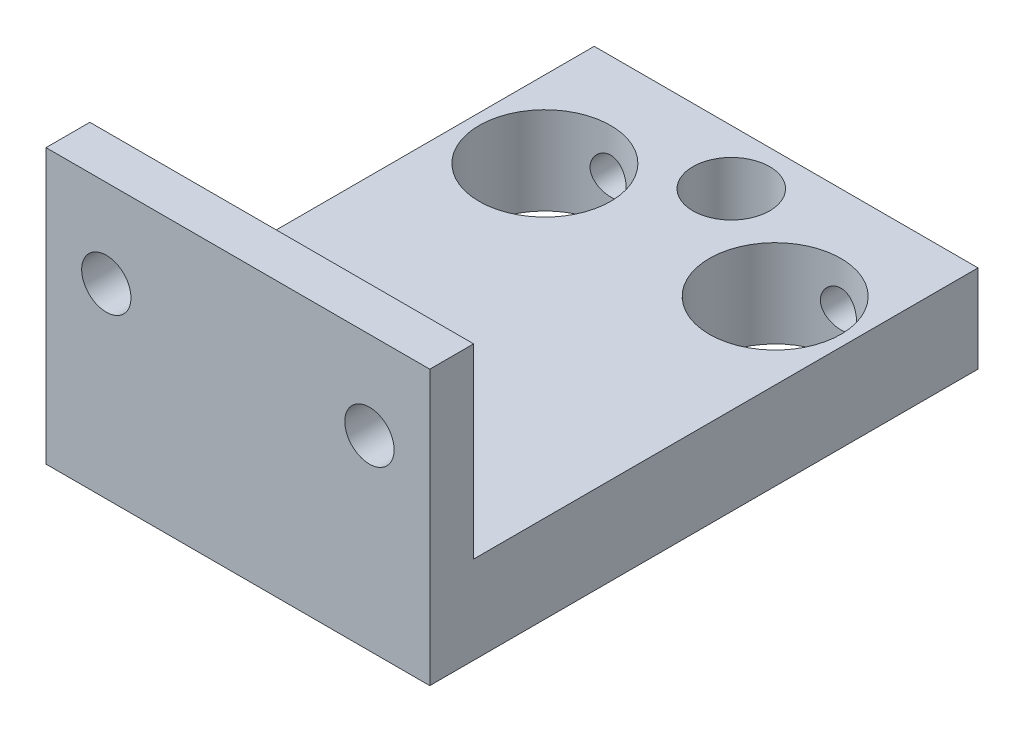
ISO-10303-21;
HEADER;
FILE_DESCRIPTION(('STEP AP214'),'2;1');
FILE_NAME('part.step','',(''),(''),'','','');
FILE_SCHEMA(('AUTOMOTIVE_DESIGN { 1 0 10303 214 1 1 1 1 }'));
ENDSEC;
DATA;
#1=APPLICATION_CONTEXT('core data for automotive mechanical design processes');
#2=APPLICATION_PROTOCOL_DEFINITION('international standard','automotive_design',2000,#1);
#3=PRODUCT_CONTEXT('',#1,'mechanical');
#4=PRODUCT('Part','Part','',(#3));
#5=PRODUCT_RELATED_PRODUCT_CATEGORY('part','',(#4));
#6=PRODUCT_DEFINITION_FORMATION('','',#4);
#7=PRODUCT_DEFINITION_CONTEXT('part definition',#1,'design');
#8=PRODUCT_DEFINITION('design','',#6,#7);
#9=PRODUCT_DEFINITION_SHAPE('','',#8);
#10=(LENGTH_UNIT() NAMED_UNIT(*) SI_UNIT(.MILLI.,.METRE.));
#11=(NAMED_UNIT(*) PLANE_ANGLE_UNIT() SI_UNIT($,.RADIAN.));
#12=(NAMED_UNIT(*) SI_UNIT($,.STERADIAN.) SOLID_ANGLE_UNIT());
#13=UNCERTAINTY_MEASURE_WITH_UNIT(LENGTH_MEASURE(1.E-05),#10,'distance_accuracy_value','');
#14=(GEOMETRIC_REPRESENTATION_CONTEXT(3) GLOBAL_UNCERTAINTY_ASSIGNED_CONTEXT((#13)) GLOBAL_UNIT_ASSIGNED_CONTEXT((#10,
#11,#12)) REPRESENTATION_CONTEXT('',''));
#15=CARTESIAN_POINT('',(0.,0.,0.));
#16=DIRECTION('',(0.,0.,1.));
#17=DIRECTION('',(1.,0.,0.));
#18=AXIS2_PLACEMENT_3D('',#15,#16,#17);
#19=CARTESIAN_POINT('',(-12.,9.,2.));
#20=DIRECTION('',(0.,0.,-1.));
#21=DIRECTION('',(-1.,0.,0.));
#22=AXIS2_PLACEMENT_3D('',#19,#20,#21);
#23=CYLINDRICAL_SURFACE('',#22,2.25);
#24=CARTESIAN_POINT('',(-12.,9.,2.));
#25=DIRECTION('',(0.,0.,-1.));
#26=DIRECTION('',(-1.,0.,0.));
#27=AXIS2_PLACEMENT_3D('',#24,#25,#26);
#28=CIRCLE('',#27,2.25);
#29=CARTESIAN_POINT('',(-14.25,9.,2.));
#30=VERTEX_POINT('',#29);
#31=EDGE_CURVE('E130',#30,#30,#28,.F.);
#32=ORIENTED_EDGE('',*,*,#31,.T.);
#33=EDGE_LOOP('',(#32));
#34=FACE_BOUND('',#33,.T.);
#35=CARTESIAN_POINT('',(-12.,9.,-2.));
#36=DIRECTION('',(0.,0.,-1.));
#37=DIRECTION('',(-1.,0.,0.));
#38=AXIS2_PLACEMENT_3D('',#35,#36,#37);
#39=CIRCLE('',#38,2.25);
#40=CARTESIAN_POINT('',(-14.25,9.,-2.));
#41=VERTEX_POINT('',#40);
#42=EDGE_CURVE('E20',#41,#41,#39,.T.);
#43=ORIENTED_EDGE('',*,*,#42,.T.);
#44=EDGE_LOOP('',(#43));
#45=FACE_BOUND('',#44,.T.);
#46=ADVANCED_FACE('F17',(#34,#45),#23,.F.);
#47=CARTESIAN_POINT('',(12.,9.,2.));
#48=DIRECTION('',(0.,0.,-1.));
#49=DIRECTION('',(-1.,0.,0.));
#50=AXIS2_PLACEMENT_3D('',#47,#48,#49);
#51=CYLINDRICAL_SURFACE('',#50,2.25);
#52=CARTESIAN_POINT('',(12.,9.,2.));
#53=DIRECTION('',(0.,0.,-1.));
#54=DIRECTION('',(-1.,0.,0.));
#55=AXIS2_PLACEMENT_3D('',#52,#53,#54);
#56=CIRCLE('',#55,2.25);
#57=CARTESIAN_POINT('',(9.75,9.,2.));
#58=VERTEX_POINT('',#57);
#59=EDGE_CURVE('E88',#58,#58,#56,.F.);
#60=ORIENTED_EDGE('',*,*,#59,.T.);
#61=EDGE_LOOP('',(#60));
#62=FACE_BOUND('',#61,.T.);
#63=CARTESIAN_POINT('',(12.,9.,-2.));
#64=DIRECTION('',(0.,0.,-1.));
#65=DIRECTION('',(-1.,0.,0.));
#66=AXIS2_PLACEMENT_3D('',#63,#64,#65);
#67=CIRCLE('',#66,2.25);
#68=CARTESIAN_POINT('',(9.75,9.,-2.));
#69=VERTEX_POINT('',#68);
#70=EDGE_CURVE('E107',#69,#69,#67,.T.);
#71=ORIENTED_EDGE('',*,*,#70,.T.);
#72=EDGE_LOOP('',(#71));
#73=FACE_BOUND('',#72,.T.);
#74=ADVANCED_FACE('F174',(#62,#73),#51,.F.);
#75=CARTESIAN_POINT('',(10.5,-4.,-48.));
#76=DIRECTION('',(0.,0.,-1.));
#77=DIRECTION('',(-1.,0.,0.));
#78=AXIS2_PLACEMENT_3D('',#75,#76,#77);
#79=CYLINDRICAL_SURFACE('',#78,1.65);
#80=CARTESIAN_POINT('',(10.5000000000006,-2.35,-42.5));
#81=CARTESIAN_POINT('',(10.4091866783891,-2.3500039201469,-42.4999975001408));
#82=CARTESIAN_POINT('',(10.3183231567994,-2.35752577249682,-42.4979169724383));
#83=CARTESIAN_POINT('',(10.1391892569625,-2.38736942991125,-42.4898145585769));
#84=CARTESIAN_POINT('',(10.05092140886,-2.40970520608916,-42.4837889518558));
#85=CARTESIAN_POINT('',(9.87963603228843,-2.46838950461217,-42.4684615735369));
#86=CARTESIAN_POINT('',(9.79661072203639,-2.50471666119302,-42.4591647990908));
#87=CARTESIAN_POINT('',(9.63784239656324,-2.59027680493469,-42.4382745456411));
#88=CARTESIAN_POINT('',(9.562099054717,-2.63950921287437,-42.4266811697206));
#89=CARTESIAN_POINT('',(9.4181761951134,-2.7507559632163,-42.4021275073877));
#90=CARTESIAN_POINT('',(9.35019997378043,-2.8130279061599,-42.3891427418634));
#91=CARTESIAN_POINT('',(9.22549792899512,-2.94805285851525,-42.3634212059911));
#92=CARTESIAN_POINT('',(9.16877596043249,-3.020809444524,-42.3506845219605));
#93=CARTESIAN_POINT('',(9.06717908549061,-3.17639868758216,-42.3266463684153));
#94=CARTESIAN_POINT('',(9.02254721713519,-3.25939519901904,-42.3153764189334));
#95=CARTESIAN_POINT('',(8.94799532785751,-3.43202252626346,-42.2959278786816));
#96=CARTESIAN_POINT('',(8.91805785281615,-3.52164532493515,-42.2877456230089));
#97=CARTESIAN_POINT('',(8.8807309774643,-3.67642396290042,-42.277387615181));
#98=CARTESIAN_POINT('',(8.86922786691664,-3.7405455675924,-42.2741359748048));
#99=CARTESIAN_POINT('',(8.85386114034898,-3.86976950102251,-42.2697738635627));
#100=CARTESIAN_POINT('',(8.84999714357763,-3.9348717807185,-42.2686632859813));
#101=CARTESIAN_POINT('',(8.85000397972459,-4.09074021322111,-42.2686682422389));
#102=CARTESIAN_POINT('',(8.85751413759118,-4.18153077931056,-42.2708309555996));
#103=CARTESIAN_POINT('',(8.88730711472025,-4.36051289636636,-42.2792258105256));
#104=CARTESIAN_POINT('',(8.90960416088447,-4.44870185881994,-42.2854618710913));
#105=CARTESIAN_POINT('',(8.96817531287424,-4.61982002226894,-42.3012433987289));
#106=CARTESIAN_POINT('',(9.00442628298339,-4.70275766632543,-42.3107833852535));
#107=CARTESIAN_POINT('',(9.08980667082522,-4.86137719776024,-42.3320907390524));
#108=CARTESIAN_POINT('',(9.13893568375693,-4.93705931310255,-42.3438580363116));
#109=CARTESIAN_POINT('',(9.25007444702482,-5.08104289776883,-42.3686452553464));
#110=CARTESIAN_POINT('',(9.31236509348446,-5.14912357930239,-42.3816884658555));
#111=CARTESIAN_POINT('',(9.44747231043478,-5.27402964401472,-42.4073603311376));
#112=CARTESIAN_POINT('',(9.5202921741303,-5.33085149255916,-42.4199888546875));
#113=CARTESIAN_POINT('',(9.67594504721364,-5.43255988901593,-42.4436716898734));
#114=CARTESIAN_POINT('',(9.75893111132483,-5.47721993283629,-42.4546945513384));
#115=CARTESIAN_POINT('',(9.93153642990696,-5.55182691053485,-42.4736383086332));
#116=CARTESIAN_POINT('',(10.0211478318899,-5.58179095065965,-42.4815628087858));
#117=CARTESIAN_POINT('',(10.1759954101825,-5.61918713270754,-42.4915824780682));
#118=CARTESIAN_POINT('',(10.2402033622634,-5.63072114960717,-42.4947223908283));
#119=CARTESIAN_POINT('',(10.3695989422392,-5.64612882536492,-42.4989320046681));
#120=CARTESIAN_POINT('',(10.4347865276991,-5.6500028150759,-42.5000017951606));
#121=CARTESIAN_POINT('',(10.5908133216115,-5.64999607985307,-42.4999975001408));
#122=CARTESIAN_POINT('',(10.6816768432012,-5.64247422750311,-42.4979169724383));
#123=CARTESIAN_POINT('',(10.8608107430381,-5.61263057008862,-42.4898145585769));
#124=CARTESIAN_POINT('',(10.9490785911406,-5.59029479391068,-42.4837889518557));
#125=CARTESIAN_POINT('',(11.1203639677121,-5.5316104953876,-42.4684615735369));
#126=CARTESIAN_POINT('',(11.2033892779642,-5.49528333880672,-42.4591647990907));
#127=CARTESIAN_POINT('',(11.3621576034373,-5.40972319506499,-42.438274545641));
#128=CARTESIAN_POINT('',(11.4379009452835,-5.36049078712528,-42.4266811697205));
#129=CARTESIAN_POINT('',(11.5818238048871,-5.24924403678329,-42.4021275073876));
#130=CARTESIAN_POINT('',(11.64980002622,-5.18697209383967,-42.3891427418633));
#131=CARTESIAN_POINT('',(11.7745020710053,-5.05194714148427,-42.3634212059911));
#132=CARTESIAN_POINT('',(11.8312240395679,-4.9791905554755,-42.3506845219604));
#133=CARTESIAN_POINT('',(11.9328209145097,-4.82360131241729,-42.3266463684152));
#134=CARTESIAN_POINT('',(11.9774527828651,-4.7406048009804,-42.3153764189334));
#135=CARTESIAN_POINT('',(12.0520046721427,-4.56797747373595,-42.2959278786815));
#136=CARTESIAN_POINT('',(12.081942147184,-4.47835467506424,-42.2877456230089));
#137=CARTESIAN_POINT('',(12.1192690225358,-4.32357603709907,-42.277387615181));
#138=CARTESIAN_POINT('',(12.1307721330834,-4.25945443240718,-42.2741359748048));
#139=CARTESIAN_POINT('',(12.146138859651,-4.13023049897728,-42.2697738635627));
#140=CARTESIAN_POINT('',(12.1500028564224,-4.06512821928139,-42.2686632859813));
#141=CARTESIAN_POINT('',(12.1499960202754,-3.90925978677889,-42.2686682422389));
#142=CARTESIAN_POINT('',(12.1424858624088,-3.81846922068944,-42.2708309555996));
#143=CARTESIAN_POINT('',(12.1126928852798,-3.63948710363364,-42.2792258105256));
#144=CARTESIAN_POINT('',(12.0903958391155,-3.55129814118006,-42.2854618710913));
#145=CARTESIAN_POINT('',(12.0318246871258,-3.38017997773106,-42.3012433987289));
#146=CARTESIAN_POINT('',(11.9955737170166,-3.29724233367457,-42.3107833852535));
#147=CARTESIAN_POINT('',(11.9101933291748,-3.13862280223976,-42.3320907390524));
#148=CARTESIAN_POINT('',(11.8610643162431,-3.06294068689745,-42.3438580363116));
#149=CARTESIAN_POINT('',(11.7499255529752,-2.91895710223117,-42.3686452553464));
#150=CARTESIAN_POINT('',(11.6876349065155,-2.85087642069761,-42.3816884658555));
#151=CARTESIAN_POINT('',(11.5525276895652,-2.72597035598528,-42.4073603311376));
#152=CARTESIAN_POINT('',(11.4797078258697,-2.66914850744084,-42.4199888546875));
#153=CARTESIAN_POINT('',(11.3240549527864,-2.56744011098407,-42.4436716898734));
#154=CARTESIAN_POINT('',(11.2410688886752,-2.52278006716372,-42.4546945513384));
#155=CARTESIAN_POINT('',(11.068463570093,-2.44817308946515,-42.4736383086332));
#156=CARTESIAN_POINT('',(10.9788521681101,-2.41820904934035,-42.4815628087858));
#157=CARTESIAN_POINT('',(10.8240045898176,-2.38081286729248,-42.4915824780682));
#158=CARTESIAN_POINT('',(10.7597966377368,-2.36927885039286,-42.4947223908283));
#159=CARTESIAN_POINT('',(10.6304010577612,-2.35387117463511,-42.4989320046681));
#160=CARTESIAN_POINT('',(10.5652134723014,-2.34999718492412,-42.5000017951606));
#161=CARTESIAN_POINT('',(10.5000000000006,-2.35,-42.5));
#162=B_SPLINE_CURVE_WITH_KNOTS('',3,(#80,#81,#82,#83,#84,#85,#86,#87,#88,#89,#90,#91,#92,#93,
#94,#95,#96,#97,#98,#99,#100,#101,#102,#103,#104,#105,#106,#107,#108,#109,#110,#111,#112,#113,
#114,#115,#116,#117,#118,#119,#120,#121,#122,#123,#124,#125,#126,#127,#128,#129,#130,#131,#132,
#133,#134,#135,#136,#137,#138,#139,#140,#141,#142,#143,#144,#145,#146,#147,#148,#149,#150,#151,
#152,#153,#154,#155,#156,#157,#158,#159,#160,#161),.UNSPECIFIED.,.T.,.F.,(4,2,2,2,2,2,2,2,2,2,2,
2,2,2,2,2,2,2,2,2,2,2,2,2,2,2,2,2,2,2,2,2,2,2,2,2,2,2,2,2,4),(0.,0.272197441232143,
0.544651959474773,0.816692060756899,1.08871995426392,1.36673826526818,1.64485164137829,
1.92819882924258,2.21120863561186,2.40642863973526,2.60163891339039,2.8736165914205,
3.14585632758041,3.41764661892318,3.689428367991,3.96773434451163,4.24612755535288,
4.52939733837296,4.81233660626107,5.00781130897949,5.20327756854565,5.4754750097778,
5.74792952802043,6.01996962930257,6.2919975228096,6.57001583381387,6.84812920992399,
7.13147639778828,7.41448620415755,7.60970620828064,7.80491648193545,8.07689415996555,
8.34913389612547,8.62092418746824,8.89270593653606,9.17101191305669,9.44940512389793,
9.73267490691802,10.0156141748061,10.2110888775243,10.4065551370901),.UNSPECIFIED.);
#163=CARTESIAN_POINT('',(10.5000000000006,-2.35,-42.5));
#164=VERTEX_POINT('',#163);
#165=EDGE_CURVE('E164',#164,#164,#162,.T.);
#166=ORIENTED_EDGE('',*,*,#165,.T.);
#167=EDGE_LOOP('',(#166));
#168=FACE_BOUND('',#167,.T.);
#169=CARTESIAN_POINT('',(10.5,-4.,-48.));
#170=DIRECTION('',(0.,0.,-1.));
#171=DIRECTION('',(-1.,0.,0.));
#172=AXIS2_PLACEMENT_3D('',#169,#170,#171);
#173=CIRCLE('',#172,1.65);
#174=CARTESIAN_POINT('',(8.85,-4.,-48.));
#175=VERTEX_POINT('',#174);
#176=EDGE_CURVE('E125',#175,#175,#173,.T.);
#177=ORIENTED_EDGE('',*,*,#176,.T.);
#178=EDGE_LOOP('',(#177));
#179=FACE_BOUND('',#178,.T.);
#180=ADVANCED_FACE('F171',(#168,#179),#79,.F.);
#181=CARTESIAN_POINT('',(-10.5,-4.,-48.));
#182=DIRECTION('',(0.,0.,-1.));
#183=DIRECTION('',(-1.,0.,0.));
#184=AXIS2_PLACEMENT_3D('',#181,#182,#183);
#185=CYLINDRICAL_SURFACE('',#184,1.65);
#186=CARTESIAN_POINT('',(-10.4999999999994,-2.35,-42.5));
#187=CARTESIAN_POINT('',(-10.5908133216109,-2.3500039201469,-42.4999975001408));
#188=CARTESIAN_POINT('',(-10.6816768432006,-2.35752577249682,-42.4979169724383));
#189=CARTESIAN_POINT('',(-10.8608107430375,-2.38736942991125,-42.4898145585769));
#190=CARTESIAN_POINT('',(-10.94907859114,-2.40970520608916,-42.4837889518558));
#191=CARTESIAN_POINT('',(-11.1203639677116,-2.46838950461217,-42.4684615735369));
#192=CARTESIAN_POINT('',(-11.2033892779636,-2.50471666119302,-42.4591647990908));
#193=CARTESIAN_POINT('',(-11.3621576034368,-2.59027680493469,-42.4382745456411));
#194=CARTESIAN_POINT('',(-11.437900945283,-2.63950921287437,-42.4266811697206));
#195=CARTESIAN_POINT('',(-11.5818238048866,-2.7507559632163,-42.4021275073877));
#196=CARTESIAN_POINT('',(-11.6498000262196,-2.8130279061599,-42.3891427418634));
#197=CARTESIAN_POINT('',(-11.7745020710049,-2.94805285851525,-42.3634212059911));
#198=CARTESIAN_POINT('',(-11.8312240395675,-3.02080944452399,-42.3506845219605));
#199=CARTESIAN_POINT('',(-11.9328209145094,-3.17639868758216,-42.3266463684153));
#200=CARTESIAN_POINT('',(-11.9774527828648,-3.25939519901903,-42.3153764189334));
#201=CARTESIAN_POINT('',(-12.0520046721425,-3.43202252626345,-42.2959278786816));
#202=CARTESIAN_POINT('',(-12.0819421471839,-3.52164532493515,-42.2877456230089));
#203=CARTESIAN_POINT('',(-12.1192690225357,-3.67642396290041,-42.277387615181));
#204=CARTESIAN_POINT('',(-12.1307721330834,-3.7405455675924,-42.2741359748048));
#205=CARTESIAN_POINT('',(-12.146138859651,-3.86976950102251,-42.2697738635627));
#206=CARTESIAN_POINT('',(-12.1500028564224,-3.9348717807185,-42.2686632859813));
#207=CARTESIAN_POINT('',(-12.1499960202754,-4.09074021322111,-42.2686682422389));
#208=CARTESIAN_POINT('',(-12.1424858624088,-4.18153077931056,-42.2708309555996));
#209=CARTESIAN_POINT('',(-12.1126928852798,-4.36051289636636,-42.2792258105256));
#210=CARTESIAN_POINT('',(-12.0903958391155,-4.44870185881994,-42.2854618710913));
#211=CARTESIAN_POINT('',(-12.0318246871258,-4.61982002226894,-42.3012433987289));
#212=CARTESIAN_POINT('',(-11.9955737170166,-4.70275766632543,-42.3107833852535));
#213=CARTESIAN_POINT('',(-11.9101933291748,-4.86137719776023,-42.3320907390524));
#214=CARTESIAN_POINT('',(-11.8610643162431,-4.93705931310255,-42.3438580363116));
#215=CARTESIAN_POINT('',(-11.7499255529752,-5.08104289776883,-42.3686452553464));
#216=CARTESIAN_POINT('',(-11.6876349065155,-5.14912357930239,-42.3816884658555));
#217=CARTESIAN_POINT('',(-11.5525276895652,-5.27402964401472,-42.4073603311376));
#218=CARTESIAN_POINT('',(-11.4797078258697,-5.33085149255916,-42.4199888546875));
#219=CARTESIAN_POINT('',(-11.3240549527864,-5.43255988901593,-42.4436716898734));
#220=CARTESIAN_POINT('',(-11.2410688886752,-5.47721993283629,-42.4546945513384));
#221=CARTESIAN_POINT('',(-11.068463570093,-5.55182691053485,-42.4736383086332));
#222=CARTESIAN_POINT('',(-10.9788521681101,-5.58179095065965,-42.4815628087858));
#223=CARTESIAN_POINT('',(-10.8240045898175,-5.61918713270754,-42.4915824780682));
#224=CARTESIAN_POINT('',(-10.7597966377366,-5.63072114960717,-42.4947223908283));
#225=CARTESIAN_POINT('',(-10.6304010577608,-5.64612882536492,-42.4989320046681));
#226=CARTESIAN_POINT('',(-10.5652134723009,-5.6500028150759,-42.5000017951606));
#227=CARTESIAN_POINT('',(-10.4091866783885,-5.64999607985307,-42.4999975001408));
#228=CARTESIAN_POINT('',(-10.3183231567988,-5.64247422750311,-42.4979169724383));
#229=CARTESIAN_POINT('',(-10.139189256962,-5.61263057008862,-42.4898145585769));
#230=CARTESIAN_POINT('',(-10.0509214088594,-5.59029479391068,-42.4837889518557));
#231=CARTESIAN_POINT('',(-9.87963603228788,-5.5316104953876,-42.4684615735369));
#232=CARTESIAN_POINT('',(-9.79661072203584,-5.49528333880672,-42.4591647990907));
#233=CARTESIAN_POINT('',(-9.63784239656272,-5.40972319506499,-42.438274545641));
#234=CARTESIAN_POINT('',(-9.56209905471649,-5.36049078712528,-42.4266811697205));
#235=CARTESIAN_POINT('',(-9.41817619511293,-5.24924403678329,-42.4021275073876));
#236=CARTESIAN_POINT('',(-9.35019997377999,-5.18697209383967,-42.3891427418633));
#237=CARTESIAN_POINT('',(-9.22549792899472,-5.05194714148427,-42.3634212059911));
#238=CARTESIAN_POINT('',(-9.16877596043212,-4.9791905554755,-42.3506845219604));
#239=CARTESIAN_POINT('',(-9.06717908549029,-4.82360131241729,-42.3266463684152));
#240=CARTESIAN_POINT('',(-9.02254721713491,-4.7406048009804,-42.3153764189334));
#241=CARTESIAN_POINT('',(-8.94799532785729,-4.56797747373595,-42.2959278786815));
#242=CARTESIAN_POINT('',(-8.91805785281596,-4.47835467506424,-42.2877456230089));
#243=CARTESIAN_POINT('',(-8.8807309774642,-4.32357603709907,-42.277387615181));
#244=CARTESIAN_POINT('',(-8.86922786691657,-4.25945443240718,-42.2741359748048));
#245=CARTESIAN_POINT('',(-8.85386114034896,-4.13023049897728,-42.2697738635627));
#246=CARTESIAN_POINT('',(-8.84999714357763,-4.06512821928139,-42.2686632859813));
#247=CARTESIAN_POINT('',(-8.85000397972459,-3.90925978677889,-42.2686682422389));
#248=CARTESIAN_POINT('',(-8.85751413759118,-3.81846922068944,-42.2708309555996));
#249=CARTESIAN_POINT('',(-8.88730711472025,-3.63948710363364,-42.2792258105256));
#250=CARTESIAN_POINT('',(-8.90960416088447,-3.55129814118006,-42.2854618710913));
#251=CARTESIAN_POINT('',(-8.96817531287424,-3.38017997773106,-42.3012433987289));
#252=CARTESIAN_POINT('',(-9.00442628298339,-3.29724233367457,-42.3107833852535));
#253=CARTESIAN_POINT('',(-9.08980667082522,-3.13862280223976,-42.3320907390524));
#254=CARTESIAN_POINT('',(-9.13893568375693,-3.06294068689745,-42.3438580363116));
#255=CARTESIAN_POINT('',(-9.25007444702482,-2.91895710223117,-42.3686452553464));
#256=CARTESIAN_POINT('',(-9.31236509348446,-2.85087642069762,-42.3816884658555));
#257=CARTESIAN_POINT('',(-9.44747231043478,-2.72597035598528,-42.4073603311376));
#258=CARTESIAN_POINT('',(-9.5202921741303,-2.66914850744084,-42.4199888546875));
#259=CARTESIAN_POINT('',(-9.67594504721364,-2.56744011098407,-42.4436716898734));
#260=CARTESIAN_POINT('',(-9.75893111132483,-2.52278006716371,-42.4546945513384));
#261=CARTESIAN_POINT('',(-9.93153642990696,-2.44817308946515,-42.4736383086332));
#262=CARTESIAN_POINT('',(-10.02114783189,-2.41820904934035,-42.4815628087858));
#263=CARTESIAN_POINT('',(-10.1759954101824,-2.38081286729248,-42.4915824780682));
#264=CARTESIAN_POINT('',(-10.2402033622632,-2.36927885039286,-42.4947223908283));
#265=CARTESIAN_POINT('',(-10.3695989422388,-2.35387117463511,-42.4989320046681));
#266=CARTESIAN_POINT('',(-10.4347865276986,-2.34999718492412,-42.5000017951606));
#267=CARTESIAN_POINT('',(-10.4999999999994,-2.35,-42.5));
#268=B_SPLINE_CURVE_WITH_KNOTS('',3,(#186,#187,#188,#189,#190,#191,#192,#193,#194,#195,#196,
#197,#198,#199,#200,#201,#202,#203,#204,#205,#206,#207,#208,#209,#210,#211,#212,#213,#214,#215,
#216,#217,#218,#219,#220,#221,#222,#223,#224,#225,#226,#227,#228,#229,#230,#231,#232,#233,#234,
#235,#236,#237,#238,#239,#240,#241,#242,#243,#244,#245,#246,#247,#248,#249,#250,#251,#252,#253,
#254,#255,#256,#257,#258,#259,#260,#261,#262,#263,#264,#265,#266,#267),.UNSPECIFIED.,.T.,.F.,(4,
2,2,2,2,2,2,2,2,2,2,2,2,2,2,2,2,2,2,2,2,2,2,2,2,2,2,2,2,2,2,2,2,2,2,2,2,2,2,2,4),(0.,
0.272197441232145,0.544651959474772,0.8166920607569,1.08871995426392,1.36673826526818,
1.64485164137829,1.92819882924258,2.21120863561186,2.40642863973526,2.60163891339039,
2.8736165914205,3.14585632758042,3.41764661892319,3.689428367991,3.96773434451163,
4.24612755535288,4.52939733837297,4.81233660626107,5.00781130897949,5.20327756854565,
5.4754750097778,5.74792952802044,6.01996962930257,6.2919975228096,6.57001583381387,
6.84812920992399,7.13147639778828,7.41448620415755,7.60970620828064,7.80491648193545,
8.07689415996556,8.34913389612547,8.62092418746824,8.89270593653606,9.17101191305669,
9.44940512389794,9.73267490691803,10.0156141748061,10.2110888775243,10.4065551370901),.UNSPECIFIED.);
#269=CARTESIAN_POINT('',(-10.4999999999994,-2.35,-42.5));
#270=VERTEX_POINT('',#269);
#271=EDGE_CURVE('E136',#270,#270,#268,.T.);
#272=ORIENTED_EDGE('',*,*,#271,.T.);
#273=EDGE_LOOP('',(#272));
#274=FACE_BOUND('',#273,.T.);
#275=CARTESIAN_POINT('',(-10.5,-4.,-48.));
#276=DIRECTION('',(0.,0.,-1.));
#277=DIRECTION('',(-1.,0.,0.));
#278=AXIS2_PLACEMENT_3D('',#275,#276,#277);
#279=CIRCLE('',#278,1.65);
#280=CARTESIAN_POINT('',(-12.15,-4.,-48.));
#281=VERTEX_POINT('',#280);
#282=EDGE_CURVE('E121',#281,#281,#279,.T.);
#283=ORIENTED_EDGE('',*,*,#282,.T.);
#284=EDGE_LOOP('',(#283));
#285=FACE_BOUND('',#284,.T.);
#286=ADVANCED_FACE('F145',(#274,#285),#185,.F.);
#287=CARTESIAN_POINT('',(0.,17.,0.));
#288=DIRECTION('',(0.,1.,0.));
#289=DIRECTION('',(0.,0.,1.));
#290=AXIS2_PLACEMENT_3D('',#287,#288,#289);
#291=PLANE('',#290);
#292=DIRECTION('',(0.,0.,-1.));
#293=VECTOR('',#292,1.);
#294=CARTESIAN_POINT('',(-17.5,17.,-2.));
#295=LINE('',#294,#293);
#296=CARTESIAN_POINT('',(-17.5,17.,-2.));
#297=VERTEX_POINT('',#296);
#298=CARTESIAN_POINT('',(-17.5,17.,2.));
#299=VERTEX_POINT('',#298);
#300=EDGE_CURVE('E71',#297,#299,#295,.F.);
#301=ORIENTED_EDGE('',*,*,#300,.T.);
#302=DIRECTION('',(-1.,0.,0.));
#303=VECTOR('',#302,1.);
#304=CARTESIAN_POINT('',(-17.5,17.,2.));
#305=LINE('',#304,#303);
#306=CARTESIAN_POINT('',(17.5,17.,2.));
#307=VERTEX_POINT('',#306);
#308=EDGE_CURVE('E74',#299,#307,#305,.F.);
#309=ORIENTED_EDGE('',*,*,#308,.T.);
#310=DIRECTION('',(0.,0.,1.));
#311=VECTOR('',#310,1.);
#312=CARTESIAN_POINT('',(17.5,17.,-2.));
#313=LINE('',#312,#311);
#314=CARTESIAN_POINT('',(17.5,17.,-2.));
#315=VERTEX_POINT('',#314);
#316=EDGE_CURVE('E244',#307,#315,#313,.F.);
#317=ORIENTED_EDGE('',*,*,#316,.T.);
#318=DIRECTION('',(1.,0.,0.));
#319=VECTOR('',#318,1.);
#320=CARTESIAN_POINT('',(-17.5,17.,-2.));
#321=LINE('',#320,#319);
#322=EDGE_CURVE('E68',#315,#297,#321,.F.);
#323=ORIENTED_EDGE('',*,*,#322,.T.);
#324=EDGE_LOOP('',(#301,#309,#317,#323));
#325=FACE_BOUND('',#324,.T.);
#326=ADVANCED_FACE('F73',(#325),#291,.T.);
#327=CARTESIAN_POINT('',(-17.5,17.,-2.));
#328=DIRECTION('',(0.,0.,1.));
#329=DIRECTION('',(1.,0.,0.));
#330=AXIS2_PLACEMENT_3D('',#327,#328,#329);
#331=PLANE('',#330);
#332=DIRECTION('',(0.,1.,0.));
#333=VECTOR('',#332,1.);
#334=CARTESIAN_POINT('',(-17.5,17.,-2.));
#335=LINE('',#334,#333);
#336=CARTESIAN_POINT('',(-17.5,0.,-2.));
#337=VERTEX_POINT('',#336);
#338=EDGE_CURVE('E98',#337,#297,#335,.T.);
#339=ORIENTED_EDGE('',*,*,#338,.T.);
#340=ORIENTED_EDGE('',*,*,#322,.F.);
#341=DIRECTION('',(0.,1.,0.));
#342=VECTOR('',#341,1.);
#343=CARTESIAN_POINT('',(17.5,17.,-2.));
#344=LINE('',#343,#342);
#345=CARTESIAN_POINT('',(17.5,0.,-2.));
#346=VERTEX_POINT('',#345);
#347=EDGE_CURVE('E246',#315,#346,#344,.F.);
#348=ORIENTED_EDGE('',*,*,#347,.T.);
#349=DIRECTION('',(1.,0.,0.));
#350=VECTOR('',#349,1.);
#351=CARTESIAN_POINT('',(-17.5,0.,-2.));
#352=LINE('',#351,#350);
#353=EDGE_CURVE('E102',#337,#346,#352,.T.);
#354=ORIENTED_EDGE('',*,*,#353,.F.);
#355=EDGE_LOOP('',(#339,#340,#348,#354));
#356=FACE_BOUND('',#355,.T.);
#357=ORIENTED_EDGE('',*,*,#70,.F.);
#358=EDGE_LOOP('',(#357));
#359=FACE_BOUND('',#358,.T.);
#360=ORIENTED_EDGE('',*,*,#42,.F.);
#361=EDGE_LOOP('',(#360));
#362=FACE_BOUND('',#361,.T.);
#363=ADVANCED_FACE('F215',(#356,#359,#362),#331,.F.);
#364=CARTESIAN_POINT('',(-17.5,0.,-48.));
#365=DIRECTION('',(0.,1.,0.));
#366=DIRECTION('',(0.,0.,1.));
#367=AXIS2_PLACEMENT_3D('',#364,#365,#366);
#368=PLANE('',#367);
#369=DIRECTION('',(1.,0.,0.));
#370=VECTOR('',#369,1.);
#371=CARTESIAN_POINT('',(0.,0.,-48.));
#372=LINE('',#371,#370);
#373=CARTESIAN_POINT('',(17.5,0.,-48.));
#374=VERTEX_POINT('',#373);
#375=CARTESIAN_POINT('',(-17.5,0.,-48.));
#376=VERTEX_POINT('',#375);
#377=EDGE_CURVE('E124',#374,#376,#372,.F.);
#378=ORIENTED_EDGE('',*,*,#377,.T.);
#379=DIRECTION('',(0.,0.,-1.));
#380=VECTOR('',#379,1.);
#381=CARTESIAN_POINT('',(-17.5,0.,-2.));
#382=LINE('',#381,#380);
#383=EDGE_CURVE('E95',#376,#337,#382,.F.);
#384=ORIENTED_EDGE('',*,*,#383,.T.);
#385=ORIENTED_EDGE('',*,*,#353,.T.);
#386=DIRECTION('',(0.,0.,1.));
#387=VECTOR('',#386,1.);
#388=CARTESIAN_POINT('',(17.5,0.,-2.));
#389=LINE('',#388,#387);
#390=EDGE_CURVE('E248',#346,#374,#389,.F.);
#391=ORIENTED_EDGE('',*,*,#390,.T.);
#392=EDGE_LOOP('',(#378,#384,#385,#391));
#393=FACE_BOUND('',#392,.T.);
#394=CARTESIAN_POINT('',(0.,0.,-11.));
#395=DIRECTION('',(0.,1.,0.));
#396=DIRECTION('',(0.,0.,1.));
#397=AXIS2_PLACEMENT_3D('',#394,#395,#396);
#398=CIRCLE('',#397,1.65);
#399=CARTESIAN_POINT('',(0.,0.,-9.35));
#400=VERTEX_POINT('',#399);
#401=EDGE_CURVE('E133',#400,#400,#398,.F.);
#402=ORIENTED_EDGE('',*,*,#401,.T.);
#403=EDGE_LOOP('',(#402));
#404=FACE_BOUND('',#403,.T.);
#405=CARTESIAN_POINT('',(-10.5,0.,-36.5));
#406=DIRECTION('',(0.,1.,0.));
#407=DIRECTION('',(0.,0.,1.));
#408=AXIS2_PLACEMENT_3D('',#405,#406,#407);
#409=CIRCLE('',#408,6.);
#410=CARTESIAN_POINT('',(-10.5,0.,-30.5));
#411=VERTEX_POINT('',#410);
#412=EDGE_CURVE('E143',#411,#411,#409,.F.);
#413=ORIENTED_EDGE('',*,*,#412,.T.);
#414=EDGE_LOOP('',(#413));
#415=FACE_BOUND('',#414,.T.);
#416=CARTESIAN_POINT('',(10.5,0.,-36.5));
#417=DIRECTION('',(0.,1.,0.));
#418=DIRECTION('',(0.,0.,1.));
#419=AXIS2_PLACEMENT_3D('',#416,#417,#418);
#420=CIRCLE('',#419,6.);
#421=CARTESIAN_POINT('',(10.5,0.,-30.5));
#422=VERTEX_POINT('',#421);
#423=EDGE_CURVE('E169',#422,#422,#420,.F.);
#424=ORIENTED_EDGE('',*,*,#423,.T.);
#425=EDGE_LOOP('',(#424));
#426=FACE_BOUND('',#425,.T.);
#427=CARTESIAN_POINT('',(0.,0.,-43.));
#428=DIRECTION('',(0.,1.,0.));
#429=DIRECTION('',(0.,0.,1.));
#430=AXIS2_PLACEMENT_3D('',#427,#428,#429);
#431=CIRCLE('',#430,3.5);
#432=CARTESIAN_POINT('',(0.,0.,-39.5));
#433=VERTEX_POINT('',#432);
#434=EDGE_CURVE('E105',#433,#433,#431,.F.);
#435=ORIENTED_EDGE('',*,*,#434,.T.);
#436=EDGE_LOOP('',(#435));
#437=FACE_BOUND('',#436,.T.);
#438=ADVANCED_FACE('F212',(#393,#404,#415,#426,#437),#368,.T.);
#439=CARTESIAN_POINT('',(0.,0.,-43.));
#440=DIRECTION('',(0.,1.,0.));
#441=DIRECTION('',(0.,0.,1.));
#442=AXIS2_PLACEMENT_3D('',#439,#440,#441);
#443=CYLINDRICAL_SURFACE('',#442,3.5);
#444=CARTESIAN_POINT('',(0.,-8.,-43.));
#445=DIRECTION('',(0.,1.,0.));
#446=DIRECTION('',(0.,0.,1.));
#447=AXIS2_PLACEMENT_3D('',#444,#445,#446);
#448=CIRCLE('',#447,3.5);
#449=CARTESIAN_POINT('',(0.,-8.,-39.5));
#450=VERTEX_POINT('',#449);
#451=EDGE_CURVE('E118',#450,#450,#448,.T.);
#452=ORIENTED_EDGE('',*,*,#451,.F.);
#453=EDGE_LOOP('',(#452));
#454=FACE_BOUND('',#453,.T.);
#455=ORIENTED_EDGE('',*,*,#434,.F.);
#456=EDGE_LOOP('',(#455));
#457=FACE_BOUND('',#456,.T.);
#458=ADVANCED_FACE('F161',(#454,#457),#443,.F.);
#459=CARTESIAN_POINT('',(10.5,-8.,-36.5));
#460=DIRECTION('',(0.,1.,0.));
#461=DIRECTION('',(0.,0.,1.));
#462=AXIS2_PLACEMENT_3D('',#459,#460,#461);
#463=CYLINDRICAL_SURFACE('',#462,6.);
#464=ORIENTED_EDGE('',*,*,#423,.F.);
#465=EDGE_LOOP('',(#464));
#466=FACE_BOUND('',#465,.T.);
#467=ORIENTED_EDGE('',*,*,#165,.F.);
#468=EDGE_LOOP('',(#467));
#469=FACE_BOUND('',#468,.T.);
#470=CARTESIAN_POINT('',(10.5,-8.,-36.5));
#471=DIRECTION('',(0.,1.,0.));
#472=DIRECTION('',(0.,0.,1.));
#473=AXIS2_PLACEMENT_3D('',#470,#471,#472);
#474=CIRCLE('',#473,6.);
#475=CARTESIAN_POINT('',(10.5,-8.,-30.5));
#476=VERTEX_POINT('',#475);
#477=EDGE_CURVE('E115',#476,#476,#474,.T.);
#478=ORIENTED_EDGE('',*,*,#477,.F.);
#479=EDGE_LOOP('',(#478));
#480=FACE_BOUND('',#479,.T.);
#481=ADVANCED_FACE('F155',(#466,#469,#480),#463,.F.);
#482=CARTESIAN_POINT('',(-10.5,-8.,-36.5));
#483=DIRECTION('',(0.,1.,0.));
#484=DIRECTION('',(0.,0.,1.));
#485=AXIS2_PLACEMENT_3D('',#482,#483,#484);
#486=CYLINDRICAL_SURFACE('',#485,6.);
#487=ORIENTED_EDGE('',*,*,#412,.F.);
#488=EDGE_LOOP('',(#487));
#489=FACE_BOUND('',#488,.T.);
#490=ORIENTED_EDGE('',*,*,#271,.F.);
#491=EDGE_LOOP('',(#490));
#492=FACE_BOUND('',#491,.T.);
#493=CARTESIAN_POINT('',(-10.5,-8.,-36.5));
#494=DIRECTION('',(0.,1.,0.));
#495=DIRECTION('',(0.,0.,1.));
#496=AXIS2_PLACEMENT_3D('',#493,#494,#495);
#497=CIRCLE('',#496,6.);
#498=CARTESIAN_POINT('',(-10.5,-8.,-30.5));
#499=VERTEX_POINT('',#498);
#500=EDGE_CURVE('E112',#499,#499,#497,.T.);
#501=ORIENTED_EDGE('',*,*,#500,.F.);
#502=EDGE_LOOP('',(#501));
#503=FACE_BOUND('',#502,.T.);
#504=ADVANCED_FACE('F149',(#489,#492,#503),#486,.F.);
#505=CARTESIAN_POINT('',(0.,0.,-11.));
#506=DIRECTION('',(0.,1.,0.));
#507=DIRECTION('',(0.,0.,1.));
#508=AXIS2_PLACEMENT_3D('',#505,#506,#507);
#509=CYLINDRICAL_SURFACE('',#508,1.65);
#510=CARTESIAN_POINT('',(0.,-8.,-11.));
#511=DIRECTION('',(0.,1.,0.));
#512=DIRECTION('',(0.,0.,1.));
#513=AXIS2_PLACEMENT_3D('',#510,#511,#512);
#514=CIRCLE('',#513,1.65);
#515=CARTESIAN_POINT('',(0.,-8.,-9.35));
#516=VERTEX_POINT('',#515);
#517=EDGE_CURVE('E108',#516,#516,#514,.T.);
#518=ORIENTED_EDGE('',*,*,#517,.F.);
#519=EDGE_LOOP('',(#518));
#520=FACE_BOUND('',#519,.T.);
#521=ORIENTED_EDGE('',*,*,#401,.F.);
#522=EDGE_LOOP('',(#521));
#523=FACE_BOUND('',#522,.T.);
#524=ADVANCED_FACE('F154',(#520,#523),#509,.F.);
#525=CARTESIAN_POINT('',(-17.5,17.,2.));
#526=DIRECTION('',(0.,0.,-1.));
#527=DIRECTION('',(-1.,0.,0.));
#528=AXIS2_PLACEMENT_3D('',#525,#526,#527);
#529=PLANE('',#528);
#530=DIRECTION('',(1.,0.,0.));
#531=VECTOR('',#530,1.);
#532=CARTESIAN_POINT('',(-17.5,-8.,2.));
#533=LINE('',#532,#531);
#534=CARTESIAN_POINT('',(17.5,-8.,2.));
#535=VERTEX_POINT('',#534);
#536=CARTESIAN_POINT('',(-17.5,-8.,2.));
#537=VERTEX_POINT('',#536);
#538=EDGE_CURVE('E111',#535,#537,#533,.F.);
#539=ORIENTED_EDGE('',*,*,#538,.F.);
#540=DIRECTION('',(0.,1.,0.));
#541=VECTOR('',#540,1.);
#542=CARTESIAN_POINT('',(17.5,17.,2.));
#543=LINE('',#542,#541);
#544=EDGE_CURVE('E86',#535,#307,#543,.T.);
#545=ORIENTED_EDGE('',*,*,#544,.T.);
#546=ORIENTED_EDGE('',*,*,#308,.F.);
#547=DIRECTION('',(0.,1.,0.));
#548=VECTOR('',#547,1.);
#549=CARTESIAN_POINT('',(-17.5,17.,2.));
#550=LINE('',#549,#548);
#551=EDGE_CURVE('E79',#299,#537,#550,.F.);
#552=ORIENTED_EDGE('',*,*,#551,.T.);
#553=EDGE_LOOP('',(#539,#545,#546,#552));
#554=FACE_BOUND('',#553,.T.);
#555=ORIENTED_EDGE('',*,*,#59,.F.);
#556=EDGE_LOOP('',(#555));
#557=FACE_BOUND('',#556,.T.);
#558=ORIENTED_EDGE('',*,*,#31,.F.);
#559=EDGE_LOOP('',(#558));
#560=FACE_BOUND('',#559,.T.);
#561=ADVANCED_FACE('F82',(#554,#557,#560),#529,.F.);
#562=CARTESIAN_POINT('',(-17.5,17.,-2.));
#563=DIRECTION('',(1.,0.,0.));
#564=DIRECTION('',(0.,0.,-1.));
#565=AXIS2_PLACEMENT_3D('',#562,#563,#564);
#566=PLANE('',#565);
#567=ORIENTED_EDGE('',*,*,#383,.F.);
#568=DIRECTION('',(0.,1.,0.));
#569=VECTOR('',#568,1.);
#570=CARTESIAN_POINT('',(-17.5,0.,-48.));
#571=LINE('',#570,#569);
#572=CARTESIAN_POINT('',(-17.5,-8.,-48.));
#573=VERTEX_POINT('',#572);
#574=EDGE_CURVE('E242',#376,#573,#571,.F.);
#575=ORIENTED_EDGE('',*,*,#574,.T.);
#576=DIRECTION('',(0.,0.,-1.));
#577=VECTOR('',#576,1.);
#578=CARTESIAN_POINT('',(-17.5,-8.,-48.));
#579=LINE('',#578,#577);
#580=EDGE_CURVE('E93',#537,#573,#579,.T.);
#581=ORIENTED_EDGE('',*,*,#580,.F.);
#582=ORIENTED_EDGE('',*,*,#551,.F.);
#583=ORIENTED_EDGE('',*,*,#300,.F.);
#584=ORIENTED_EDGE('',*,*,#338,.F.);
#585=EDGE_LOOP('',(#567,#575,#581,#582,#583,#584));
#586=FACE_BOUND('',#585,.T.);
#587=ADVANCED_FACE('F91',(#586),#566,.F.);
#588=CARTESIAN_POINT('',(0.,0.,-48.));
#589=DIRECTION('',(0.,0.,1.));
#590=DIRECTION('',(1.,0.,0.));
#591=AXIS2_PLACEMENT_3D('',#588,#589,#590);
#592=PLANE('',#591);
#593=ORIENTED_EDGE('',*,*,#377,.F.);
#594=DIRECTION('',(0.,1.,0.));
#595=VECTOR('',#594,1.);
#596=CARTESIAN_POINT('',(17.5,17.,-48.));
#597=LINE('',#596,#595);
#598=CARTESIAN_POINT('',(17.5,-8.,-48.));
#599=VERTEX_POINT('',#598);
#600=EDGE_CURVE('E35',#374,#599,#597,.F.);
#601=ORIENTED_EDGE('',*,*,#600,.T.);
#602=DIRECTION('',(1.,0.,0.));
#603=VECTOR('',#602,1.);
#604=CARTESIAN_POINT('',(-17.5,-8.,-48.));
#605=LINE('',#604,#603);
#606=EDGE_CURVE('E26',#573,#599,#605,.T.);
#607=ORIENTED_EDGE('',*,*,#606,.F.);
#608=ORIENTED_EDGE('',*,*,#574,.F.);
#609=EDGE_LOOP('',(#593,#601,#607,#608));
#610=FACE_BOUND('',#609,.T.);
#611=ORIENTED_EDGE('',*,*,#282,.F.);
#612=EDGE_LOOP('',(#611));
#613=FACE_BOUND('',#612,.T.);
#614=ORIENTED_EDGE('',*,*,#176,.F.);
#615=EDGE_LOOP('',(#614));
#616=FACE_BOUND('',#615,.T.);
#617=ADVANCED_FACE('F192',(#610,#613,#616),#592,.F.);
#618=CARTESIAN_POINT('',(17.5,17.,-2.));
#619=DIRECTION('',(-1.,0.,0.));
#620=DIRECTION('',(0.,0.,1.));
#621=AXIS2_PLACEMENT_3D('',#618,#619,#620);
#622=PLANE('',#621);
#623=DIRECTION('',(0.,0.,-1.));
#624=VECTOR('',#623,1.);
#625=CARTESIAN_POINT('',(17.5,-8.,-48.));
#626=LINE('',#625,#624);
#627=EDGE_CURVE('E11',#599,#535,#626,.F.);
#628=ORIENTED_EDGE('',*,*,#627,.F.);
#629=ORIENTED_EDGE('',*,*,#600,.F.);
#630=ORIENTED_EDGE('',*,*,#390,.F.);
#631=ORIENTED_EDGE('',*,*,#347,.F.);
#632=ORIENTED_EDGE('',*,*,#316,.F.);
#633=ORIENTED_EDGE('',*,*,#544,.F.);
#634=EDGE_LOOP('',(#628,#629,#630,#631,#632,#633));
#635=FACE_BOUND('',#634,.T.);
#636=ADVANCED_FACE('F186',(#635),#622,.F.);
#637=CARTESIAN_POINT('',(-17.5,-8.,-48.));
#638=DIRECTION('',(0.,-1.,0.));
#639=DIRECTION('',(0.,0.,-1.));
#640=AXIS2_PLACEMENT_3D('',#637,#638,#639);
#641=PLANE('',#640);
#642=ORIENTED_EDGE('',*,*,#606,.T.);
#643=ORIENTED_EDGE('',*,*,#627,.T.);
#644=ORIENTED_EDGE('',*,*,#538,.T.);
#645=ORIENTED_EDGE('',*,*,#580,.T.);
#646=EDGE_LOOP('',(#642,#643,#644,#645));
#647=FACE_BOUND('',#646,.T.);
#648=ORIENTED_EDGE('',*,*,#517,.T.);
#649=EDGE_LOOP('',(#648));
#650=FACE_BOUND('',#649,.T.);
#651=ORIENTED_EDGE('',*,*,#500,.T.);
#652=EDGE_LOOP('',(#651));
#653=FACE_BOUND('',#652,.T.);
#654=ORIENTED_EDGE('',*,*,#477,.T.);
#655=EDGE_LOOP('',(#654));
#656=FACE_BOUND('',#655,.T.);
#657=ORIENTED_EDGE('',*,*,#451,.T.);
#658=EDGE_LOOP('',(#657));
#659=FACE_BOUND('',#658,.T.);
#660=ADVANCED_FACE('F184',(#647,#650,#653,#656,#659),#641,.T.);
#661=CLOSED_SHELL('',(#46,#74,#180,#286,#326,#363,#438,#458,#481,#504,#524,#561,#587,#617,#636,#660));
#662=MANIFOLD_SOLID_BREP('B1',#661);
#663=ADVANCED_BREP_SHAPE_REPRESENTATION('',(#18,#662),#14);
#664=SHAPE_DEFINITION_REPRESENTATION(#9,#663);
ENDSEC;
END-ISO-10303-21;
